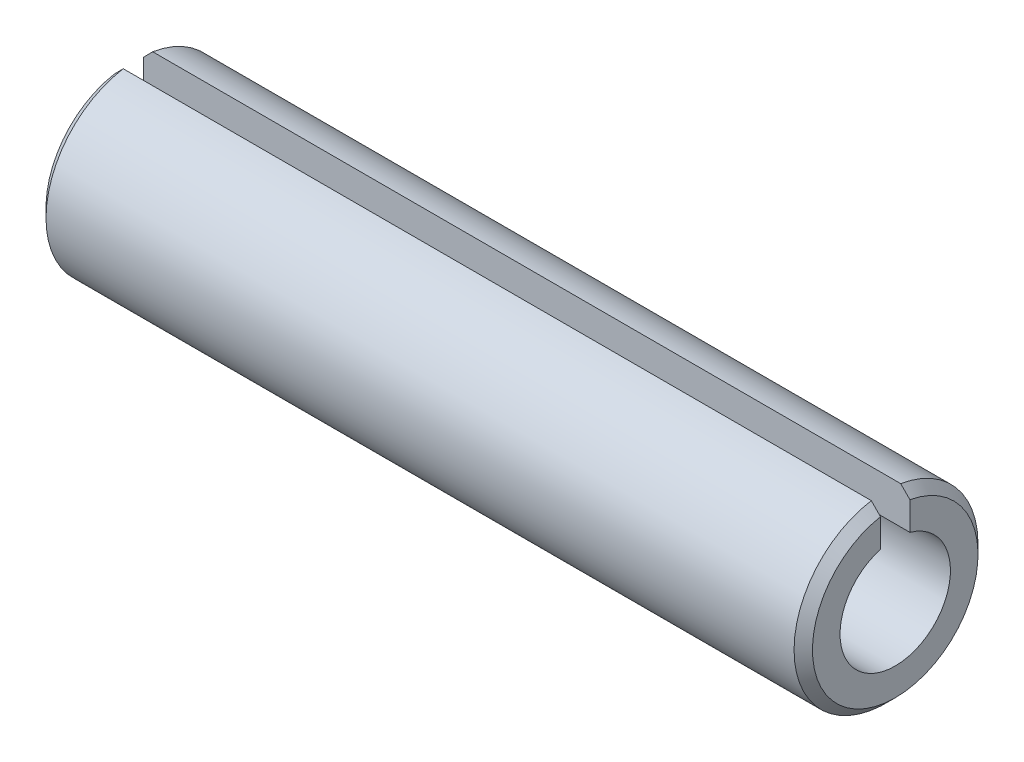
ISO-10303-21;
HEADER;
FILE_DESCRIPTION(('STEP AP214'),'2;1');
FILE_NAME('part.step','',(''),(''),'','','');
FILE_SCHEMA(('AUTOMOTIVE_DESIGN { 1 0 10303 214 1 1 1 1 }'));
ENDSEC;
DATA;
#1=APPLICATION_CONTEXT('core data for automotive mechanical design processes');
#2=APPLICATION_PROTOCOL_DEFINITION('international standard','automotive_design',2000,#1);
#3=PRODUCT_CONTEXT('',#1,'mechanical');
#4=PRODUCT('Part','Part','',(#3));
#5=PRODUCT_RELATED_PRODUCT_CATEGORY('part','',(#4));
#6=PRODUCT_DEFINITION_FORMATION('','',#4);
#7=PRODUCT_DEFINITION_CONTEXT('part definition',#1,'design');
#8=PRODUCT_DEFINITION('design','',#6,#7);
#9=PRODUCT_DEFINITION_SHAPE('','',#8);
#10=(LENGTH_UNIT() NAMED_UNIT(*) SI_UNIT(.MILLI.,.METRE.));
#11=(NAMED_UNIT(*) PLANE_ANGLE_UNIT() SI_UNIT($,.RADIAN.));
#12=(NAMED_UNIT(*) SI_UNIT($,.STERADIAN.) SOLID_ANGLE_UNIT());
#13=UNCERTAINTY_MEASURE_WITH_UNIT(LENGTH_MEASURE(1.E-05),#10,'distance_accuracy_value','');
#14=(GEOMETRIC_REPRESENTATION_CONTEXT(3) GLOBAL_UNCERTAINTY_ASSIGNED_CONTEXT((#13)) GLOBAL_UNIT_ASSIGNED_CONTEXT((#10,
#11,#12)) REPRESENTATION_CONTEXT('',''));
#15=CARTESIAN_POINT('',(0.,0.,0.));
#16=DIRECTION('',(0.,0.,1.));
#17=DIRECTION('',(1.,0.,0.));
#18=AXIS2_PLACEMENT_3D('',#15,#16,#17);
#19=CARTESIAN_POINT('',(0.,0.,0.));
#20=DIRECTION('',(-1.,0.,0.));
#21=DIRECTION('',(0.,0.,1.));
#22=AXIS2_PLACEMENT_3D('',#19,#20,#21);
#23=CYLINDRICAL_SURFACE('',#22,1.8);
#24=DIRECTION('',(-1.,0.,0.));
#25=VECTOR('',#24,1.);
#26=CARTESIAN_POINT('',(25.,1.73481987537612,0.48));
#27=LINE('',#26,#25);
#28=CARTESIAN_POINT('',(25.,1.73481987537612,0.48));
#29=VERTEX_POINT('',#28);
#30=CARTESIAN_POINT('',(0.,1.73481987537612,0.48));
#31=VERTEX_POINT('',#30);
#32=EDGE_CURVE('E47',#29,#31,#27,.T.);
#33=ORIENTED_EDGE('',*,*,#32,.F.);
#34=CARTESIAN_POINT('',(25.,0.,0.));
#35=DIRECTION('',(-1.,0.,0.));
#36=DIRECTION('',(0.,0.,1.));
#37=AXIS2_PLACEMENT_3D('',#34,#35,#36);
#38=CIRCLE('',#37,1.8);
#39=CARTESIAN_POINT('',(25.,1.73481987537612,-0.48));
#40=VERTEX_POINT('',#39);
#41=EDGE_CURVE('E96',#40,#29,#38,.T.);
#42=ORIENTED_EDGE('',*,*,#41,.F.);
#43=DIRECTION('',(-1.,0.,0.));
#44=VECTOR('',#43,1.);
#45=CARTESIAN_POINT('',(25.,1.73481987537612,-0.48));
#46=LINE('',#45,#44);
#47=CARTESIAN_POINT('',(0.,1.73481987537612,-0.48));
#48=VERTEX_POINT('',#47);
#49=EDGE_CURVE('E100',#40,#48,#46,.T.);
#50=ORIENTED_EDGE('',*,*,#49,.T.);
#51=CARTESIAN_POINT('',(0.,0.,0.));
#52=DIRECTION('',(-1.,0.,0.));
#53=DIRECTION('',(0.,0.,1.));
#54=AXIS2_PLACEMENT_3D('',#51,#52,#53);
#55=CIRCLE('',#54,1.8);
#56=EDGE_CURVE('E98',#48,#31,#55,.T.);
#57=ORIENTED_EDGE('',*,*,#56,.T.);
#58=EDGE_LOOP('',(#33,#42,#50,#57));
#59=FACE_BOUND('',#58,.T.);
#60=ADVANCED_FACE('F33',(#59),#23,.F.);
#61=CARTESIAN_POINT('',(25.,1.8,0.));
#62=DIRECTION('',(-1.,0.,0.));
#63=DIRECTION('',(0.,0.,1.));
#64=AXIS2_PLACEMENT_3D('',#61,#62,#63);
#65=PLANE('',#64);
#66=DIRECTION('',(0.,-1.,0.));
#67=VECTOR('',#66,1.);
#68=CARTESIAN_POINT('',(25.,2.96135104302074,0.48));
#69=LINE('',#68,#67);
#70=CARTESIAN_POINT('',(25.,2.65699077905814,0.48));
#71=VERTEX_POINT('',#70);
#72=EDGE_CURVE('E82',#71,#29,#69,.T.);
#73=ORIENTED_EDGE('',*,*,#72,.F.);
#74=CARTESIAN_POINT('',(25.,0.,0.));
#75=DIRECTION('',(-1.,0.,0.));
#76=DIRECTION('',(0.,0.,1.));
#77=AXIS2_PLACEMENT_3D('',#74,#75,#76);
#78=CIRCLE('',#77,2.7);
#79=CARTESIAN_POINT('',(25.,2.65699077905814,-0.48));
#80=VERTEX_POINT('',#79);
#81=EDGE_CURVE('E104',#80,#71,#78,.T.);
#82=ORIENTED_EDGE('',*,*,#81,.F.);
#83=DIRECTION('',(0.,-1.,0.));
#84=VECTOR('',#83,1.);
#85=CARTESIAN_POINT('',(25.,2.96135104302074,-0.48));
#86=LINE('',#85,#84);
#87=EDGE_CURVE('E90',#80,#40,#86,.T.);
#88=ORIENTED_EDGE('',*,*,#87,.T.);
#89=ORIENTED_EDGE('',*,*,#41,.T.);
#90=EDGE_LOOP('',(#73,#82,#88,#89));
#91=FACE_BOUND('',#90,.T.);
#92=ADVANCED_FACE('F103',(#91),#65,.F.);
#93=CARTESIAN_POINT('',(25.,0.,0.));
#94=DIRECTION('',(-1.,0.,0.));
#95=DIRECTION('',(0.,0.,1.));
#96=AXIS2_PLACEMENT_3D('',#93,#94,#95);
#97=CONICAL_SURFACE('',#96,2.7,0.785398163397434);
#98=CARTESIAN_POINT('',(23.172376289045,4.50210800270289,0.48));
#99=CARTESIAN_POINT('',(23.3124694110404,4.36121634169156,0.48));
#100=CARTESIAN_POINT('',(23.4525296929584,4.22029197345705,0.48));
#101=CARTESIAN_POINT('',(23.7325483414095,3.93834411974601,0.48));
#102=CARTESIAN_POINT('',(23.8725067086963,3.797320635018,0.48));
#103=CARTESIAN_POINT('',(24.1522810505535,3.51514513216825,0.48));
#104=CARTESIAN_POINT('',(24.2920970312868,3.37399312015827,0.48));
#105=CARTESIAN_POINT('',(24.5715338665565,3.09149379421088,0.48));
#106=CARTESIAN_POINT('',(24.7111547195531,2.95014647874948,0.48));
#107=CARTESIAN_POINT('',(24.9901090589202,2.66714775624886,0.48));
#108=CARTESIAN_POINT('',(25.1294425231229,2.52549632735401,0.48));
#109=CARTESIAN_POINT('',(25.4076320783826,2.24172964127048,0.48));
#110=CARTESIAN_POINT('',(25.5464881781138,2.09961439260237,0.48));
#111=CARTESIAN_POINT('',(25.7541331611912,1.88580999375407,0.48));
#112=CARTESIAN_POINT('',(25.823244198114,1.81443392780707,0.48));
#113=CARTESIAN_POINT('',(25.9611585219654,1.67138644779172,0.48));
#114=CARTESIAN_POINT('',(26.0299618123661,1.59971503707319,0.48));
#115=CARTESIAN_POINT('',(26.1671274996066,1.45594150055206,0.48));
#116=CARTESIAN_POINT('',(26.2354898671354,1.38383934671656,0.48));
#117=CARTESIAN_POINT('',(26.3375138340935,1.27519517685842,0.48));
#118=CARTESIAN_POINT('',(26.3714358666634,1.23889793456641,0.48));
#119=CARTESIAN_POINT('',(26.4390521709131,1.16609108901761,0.48));
#120=CARTESIAN_POINT('',(26.4727464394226,1.12958148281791,0.48));
#121=CARTESIAN_POINT('',(26.5062992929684,1.09294161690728,0.48));
#122=B_SPLINE_CURVE_WITH_KNOTS('',3,(#98,#99,#100,#101,#102,#103,#104,#105,#106,#107,#108,#109,
#110,#111,#112,#113,#114,#115,#116,#117,#118,#119,#120,#121),.UNSPECIFIED.,.F.,.F.,(4,2,2,2,2,2,
2,2,2,2,2,4),(0.,0.596061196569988,1.19211793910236,1.78814768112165,2.38418210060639,
2.98026089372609,3.57632879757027,3.87438502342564,4.17243787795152,4.47051034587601,
4.61955225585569,4.76859623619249),.UNSPECIFIED.);
#123=CARTESIAN_POINT('',(24.7,2.96135104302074,0.48));
#124=VERTEX_POINT('',#123);
#125=EDGE_CURVE('E85',#124,#71,#122,.T.);
#126=ORIENTED_EDGE('',*,*,#125,.F.);
#127=CARTESIAN_POINT('',(24.7,0.,0.));
#128=DIRECTION('',(-1.,0.,0.));
#129=DIRECTION('',(0.,0.,1.));
#130=AXIS2_PLACEMENT_3D('',#127,#128,#129);
#131=CIRCLE('',#130,3.);
#132=CARTESIAN_POINT('',(24.7,2.96135104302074,-0.48));
#133=VERTEX_POINT('',#132);
#134=EDGE_CURVE('E106',#133,#124,#131,.T.);
#135=ORIENTED_EDGE('',*,*,#134,.F.);
#136=CARTESIAN_POINT('',(23.172376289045,4.50210800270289,-0.48));
#137=CARTESIAN_POINT('',(23.3124694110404,4.36121634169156,-0.48));
#138=CARTESIAN_POINT('',(23.4525296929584,4.22029197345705,-0.48));
#139=CARTESIAN_POINT('',(23.7325483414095,3.93834411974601,-0.48));
#140=CARTESIAN_POINT('',(23.8725067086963,3.797320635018,-0.48));
#141=CARTESIAN_POINT('',(24.1522810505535,3.51514513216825,-0.48));
#142=CARTESIAN_POINT('',(24.2920970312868,3.37399312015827,-0.48));
#143=CARTESIAN_POINT('',(24.5715338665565,3.09149379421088,-0.48));
#144=CARTESIAN_POINT('',(24.7111547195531,2.95014647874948,-0.48));
#145=CARTESIAN_POINT('',(24.9901090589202,2.66714775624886,-0.48));
#146=CARTESIAN_POINT('',(25.1294425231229,2.52549632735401,-0.48));
#147=CARTESIAN_POINT('',(25.4076320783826,2.24172964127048,-0.48));
#148=CARTESIAN_POINT('',(25.5464881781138,2.09961439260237,-0.48));
#149=CARTESIAN_POINT('',(25.7541331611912,1.88580999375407,-0.48));
#150=CARTESIAN_POINT('',(25.823244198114,1.81443392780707,-0.48));
#151=CARTESIAN_POINT('',(25.9611585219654,1.67138644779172,-0.48));
#152=CARTESIAN_POINT('',(26.0299618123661,1.59971503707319,-0.48));
#153=CARTESIAN_POINT('',(26.1671274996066,1.45594150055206,-0.48));
#154=CARTESIAN_POINT('',(26.2354898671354,1.38383934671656,-0.48));
#155=CARTESIAN_POINT('',(26.3375138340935,1.27519517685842,-0.48));
#156=CARTESIAN_POINT('',(26.3714358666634,1.23889793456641,-0.48));
#157=CARTESIAN_POINT('',(26.4390521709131,1.16609108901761,-0.48));
#158=CARTESIAN_POINT('',(26.4727464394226,1.12958148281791,-0.48));
#159=CARTESIAN_POINT('',(26.5062992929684,1.09294161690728,-0.48));
#160=B_SPLINE_CURVE_WITH_KNOTS('',3,(#136,#137,#138,#139,#140,#141,#142,#143,#144,#145,#146,
#147,#148,#149,#150,#151,#152,#153,#154,#155,#156,#157,#158,#159),.UNSPECIFIED.,.F.,.F.,(4,2,2,
2,2,2,2,2,2,2,2,4),(0.,0.596061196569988,1.19211793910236,1.78814768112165,2.38418210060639,
2.98026089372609,3.57632879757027,3.87438502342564,4.17243787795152,4.47051034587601,
4.61955225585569,4.76859623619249),.UNSPECIFIED.);
#161=EDGE_CURVE('E154',#133,#80,#160,.T.);
#162=ORIENTED_EDGE('',*,*,#161,.T.);
#163=ORIENTED_EDGE('',*,*,#81,.T.);
#164=EDGE_LOOP('',(#126,#135,#162,#163));
#165=FACE_BOUND('',#164,.T.);
#166=ADVANCED_FACE('F130',(#165),#97,.T.);
#167=CARTESIAN_POINT('',(0.,0.,0.));
#168=DIRECTION('',(-1.,0.,0.));
#169=DIRECTION('',(0.,0.,1.));
#170=AXIS2_PLACEMENT_3D('',#167,#168,#169);
#171=CYLINDRICAL_SURFACE('',#170,3.);
#172=DIRECTION('',(-1.,0.,0.));
#173=VECTOR('',#172,1.);
#174=CARTESIAN_POINT('',(25.,2.96135104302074,0.48));
#175=LINE('',#174,#173);
#176=CARTESIAN_POINT('',(0.3,2.96135104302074,0.48));
#177=VERTEX_POINT('',#176);
#178=EDGE_CURVE('E99',#124,#177,#175,.T.);
#179=ORIENTED_EDGE('',*,*,#178,.T.);
#180=CARTESIAN_POINT('',(0.299999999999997,0.,0.));
#181=DIRECTION('',(-1.,0.,0.));
#182=DIRECTION('',(0.,0.,1.));
#183=AXIS2_PLACEMENT_3D('',#180,#181,#182);
#184=CIRCLE('',#183,3.);
#185=CARTESIAN_POINT('',(0.3,2.96135104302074,-0.48));
#186=VERTEX_POINT('',#185);
#187=EDGE_CURVE('E111',#186,#177,#184,.T.);
#188=ORIENTED_EDGE('',*,*,#187,.F.);
#189=DIRECTION('',(-1.,0.,0.));
#190=VECTOR('',#189,1.);
#191=CARTESIAN_POINT('',(25.,2.96135104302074,-0.48));
#192=LINE('',#191,#190);
#193=EDGE_CURVE('E167',#133,#186,#192,.T.);
#194=ORIENTED_EDGE('',*,*,#193,.F.);
#195=ORIENTED_EDGE('',*,*,#134,.T.);
#196=EDGE_LOOP('',(#179,#188,#194,#195));
#197=FACE_BOUND('',#196,.T.);
#198=ADVANCED_FACE('F146',(#197),#171,.T.);
#199=CARTESIAN_POINT('',(0.299999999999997,0.,0.));
#200=DIRECTION('',(1.,0.,0.));
#201=DIRECTION('',(0.,0.,-1.));
#202=AXIS2_PLACEMENT_3D('',#199,#200,#201);
#203=CONICAL_SURFACE('',#202,3.,0.785398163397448);
#204=CARTESIAN_POINT('',(-1.50629929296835,1.09294161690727,0.48));
#205=CARTESIAN_POINT('',(-1.46693034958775,1.13592876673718,0.48));
#206=CARTESIAN_POINT('',(-1.4273696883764,1.17873905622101,0.48));
#207=CARTESIAN_POINT('',(-1.34794781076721,1.26407862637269,0.48));
#208=CARTESIAN_POINT('',(-1.30808659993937,1.30660791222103,0.48));
#209=CARTESIAN_POINT('',(-1.18817777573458,1.4338819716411,0.48));
#210=CARTESIAN_POINT('',(-1.10780149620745,1.51831671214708,0.48));
#211=CARTESIAN_POINT('',(-0.946523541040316,1.6866701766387,0.48));
#212=CARTESIAN_POINT('',(-0.865621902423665,1.77058893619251,0.48));
#213=CARTESIAN_POINT('',(-0.70346677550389,1.93808758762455,0.48));
#214=CARTESIAN_POINT('',(-0.622213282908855,2.02166747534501,0.48));
#215=CARTESIAN_POINT('',(-0.426172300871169,2.22274153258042,0.48));
#216=CARTESIAN_POINT('',(-0.31126644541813,2.34012021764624,0.48));
#217=CARTESIAN_POINT('',(-0.0811489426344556,2.57458258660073,0.48));
#218=CARTESIAN_POINT('',(0.0340627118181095,2.69166626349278,0.48));
#219=CARTESIAN_POINT('',(0.428327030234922,3.09165947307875,0.48));
#220=CARTESIAN_POINT('',(0.707859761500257,3.37409563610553,0.48));
#221=CARTESIAN_POINT('',(1.12753512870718,3.79735781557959,0.48));
#222=CARTESIAN_POINT('',(1.26748509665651,3.93837530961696,0.48));
#223=CARTESIAN_POINT('',(1.54748573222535,4.2203099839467,0.48));
#224=CARTESIAN_POINT('',(1.68753639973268,4.36122716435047,0.48));
#225=CARTESIAN_POINT('',(1.82762371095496,4.50210800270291,0.48));
#226=B_SPLINE_CURVE_WITH_KNOTS('',3,(#204,#205,#206,#207,#208,#209,#210,#211,#212,#213,#214,
#215,#216,#217,#218,#219,#220,#221,#222,#223,#224,#225),.UNSPECIFIED.,.F.,.F.,(4,2,2,2,2,2,2,2,
2,2,4),(0.,0.17487022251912,0.349737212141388,0.699455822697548,1.0491500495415,
1.39884855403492,1.89162547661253,2.38441397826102,3.57654376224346,4.17257009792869,
4.76859577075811),.UNSPECIFIED.);
#227=CARTESIAN_POINT('',(0.,2.65699077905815,0.48));
#228=VERTEX_POINT('',#227);
#229=EDGE_CURVE('E124',#228,#177,#226,.T.);
#230=ORIENTED_EDGE('',*,*,#229,.F.);
#231=CARTESIAN_POINT('',(0.,0.,0.));
#232=DIRECTION('',(-1.,0.,0.));
#233=DIRECTION('',(0.,0.,1.));
#234=AXIS2_PLACEMENT_3D('',#231,#232,#233);
#235=CIRCLE('',#234,2.7);
#236=CARTESIAN_POINT('',(0.,2.65699077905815,-0.48));
#237=VERTEX_POINT('',#236);
#238=EDGE_CURVE('E114',#237,#228,#235,.T.);
#239=ORIENTED_EDGE('',*,*,#238,.F.);
#240=CARTESIAN_POINT('',(-1.50629929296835,1.09294161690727,-0.48));
#241=CARTESIAN_POINT('',(-1.46693034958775,1.13592876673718,-0.48));
#242=CARTESIAN_POINT('',(-1.4273696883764,1.17873905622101,-0.48));
#243=CARTESIAN_POINT('',(-1.34794781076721,1.26407862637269,-0.48));
#244=CARTESIAN_POINT('',(-1.30808659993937,1.30660791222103,-0.48));
#245=CARTESIAN_POINT('',(-1.18817777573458,1.4338819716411,-0.48));
#246=CARTESIAN_POINT('',(-1.10780149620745,1.51831671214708,-0.48));
#247=CARTESIAN_POINT('',(-0.946523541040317,1.6866701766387,-0.48));
#248=CARTESIAN_POINT('',(-0.865621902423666,1.7705889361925,-0.48));
#249=CARTESIAN_POINT('',(-0.70346677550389,1.93808758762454,-0.48));
#250=CARTESIAN_POINT('',(-0.622213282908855,2.02166747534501,-0.48));
#251=CARTESIAN_POINT('',(-0.426172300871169,2.22274153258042,-0.48));
#252=CARTESIAN_POINT('',(-0.31126644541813,2.34012021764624,-0.48));
#253=CARTESIAN_POINT('',(-0.0811489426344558,2.57458258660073,-0.48));
#254=CARTESIAN_POINT('',(0.0340627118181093,2.69166626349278,-0.48));
#255=CARTESIAN_POINT('',(0.428327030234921,3.09165947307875,-0.48));
#256=CARTESIAN_POINT('',(0.707859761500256,3.37409563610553,-0.48));
#257=CARTESIAN_POINT('',(1.12753512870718,3.79735781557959,-0.48));
#258=CARTESIAN_POINT('',(1.26748509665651,3.93837530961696,-0.48));
#259=CARTESIAN_POINT('',(1.54748573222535,4.2203099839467,-0.48));
#260=CARTESIAN_POINT('',(1.68753639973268,4.36122716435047,-0.48));
#261=CARTESIAN_POINT('',(1.82762371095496,4.50210800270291,-0.48));
#262=B_SPLINE_CURVE_WITH_KNOTS('',3,(#240,#241,#242,#243,#244,#245,#246,#247,#248,#249,#250,
#251,#252,#253,#254,#255,#256,#257,#258,#259,#260,#261),.UNSPECIFIED.,.F.,.F.,(4,2,2,2,2,2,2,2,
2,2,4),(0.,0.174870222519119,0.349737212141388,0.699455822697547,1.0491500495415,
1.39884855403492,1.89162547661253,2.38441397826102,3.57654376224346,4.17257009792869,
4.76859577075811),.UNSPECIFIED.);
#263=EDGE_CURVE('E54',#237,#186,#262,.T.);
#264=ORIENTED_EDGE('',*,*,#263,.T.);
#265=ORIENTED_EDGE('',*,*,#187,.T.);
#266=EDGE_LOOP('',(#230,#239,#264,#265));
#267=FACE_BOUND('',#266,.T.);
#268=ADVANCED_FACE('F142',(#267),#203,.T.);
#269=CARTESIAN_POINT('',(0.,1.8,0.));
#270=DIRECTION('',(-1.,0.,0.));
#271=DIRECTION('',(0.,0.,1.));
#272=AXIS2_PLACEMENT_3D('',#269,#270,#271);
#273=PLANE('',#272);
#274=ORIENTED_EDGE('',*,*,#238,.T.);
#275=DIRECTION('',(0.,-1.,0.));
#276=VECTOR('',#275,1.);
#277=CARTESIAN_POINT('',(0.,1.8,0.48));
#278=LINE('',#277,#276);
#279=EDGE_CURVE('E11',#228,#31,#278,.T.);
#280=ORIENTED_EDGE('',*,*,#279,.T.);
#281=ORIENTED_EDGE('',*,*,#56,.F.);
#282=DIRECTION('',(0.,-1.,0.));
#283=VECTOR('',#282,1.);
#284=CARTESIAN_POINT('',(0.,1.8,-0.48));
#285=LINE('',#284,#283);
#286=EDGE_CURVE('E40',#237,#48,#285,.T.);
#287=ORIENTED_EDGE('',*,*,#286,.F.);
#288=EDGE_LOOP('',(#274,#280,#281,#287));
#289=FACE_BOUND('',#288,.T.);
#290=ADVANCED_FACE('F139',(#289),#273,.T.);
#291=CARTESIAN_POINT('',(25.,2.96135104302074,-0.48));
#292=DIRECTION('',(0.,0.,-1.));
#293=DIRECTION('',(0.,1.,0.));
#294=AXIS2_PLACEMENT_3D('',#291,#292,#293);
#295=PLANE('',#294);
#296=ORIENTED_EDGE('',*,*,#193,.T.);
#297=ORIENTED_EDGE('',*,*,#263,.F.);
#298=ORIENTED_EDGE('',*,*,#286,.T.);
#299=ORIENTED_EDGE('',*,*,#49,.F.);
#300=ORIENTED_EDGE('',*,*,#87,.F.);
#301=ORIENTED_EDGE('',*,*,#161,.F.);
#302=EDGE_LOOP('',(#296,#297,#298,#299,#300,#301));
#303=FACE_BOUND('',#302,.T.);
#304=ADVANCED_FACE('F137',(#303),#295,.F.);
#305=CARTESIAN_POINT('',(25.,2.96135104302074,0.48));
#306=DIRECTION('',(0.,0.,-1.));
#307=DIRECTION('',(0.,1.,0.));
#308=AXIS2_PLACEMENT_3D('',#305,#306,#307);
#309=PLANE('',#308);
#310=ORIENTED_EDGE('',*,*,#125,.T.);
#311=ORIENTED_EDGE('',*,*,#72,.T.);
#312=ORIENTED_EDGE('',*,*,#32,.T.);
#313=ORIENTED_EDGE('',*,*,#279,.F.);
#314=ORIENTED_EDGE('',*,*,#229,.T.);
#315=ORIENTED_EDGE('',*,*,#178,.F.);
#316=EDGE_LOOP('',(#310,#311,#312,#313,#314,#315));
#317=FACE_BOUND('',#316,.T.);
#318=ADVANCED_FACE('F83',(#317),#309,.T.);
#319=CLOSED_SHELL('',(#60,#92,#166,#198,#268,#290,#304,#318));
#320=MANIFOLD_SOLID_BREP('B2',#319);
#321=ADVANCED_BREP_SHAPE_REPRESENTATION('',(#18,#320),#14);
#322=SHAPE_DEFINITION_REPRESENTATION(#9,#321);
ENDSEC;
END-ISO-10303-21;
